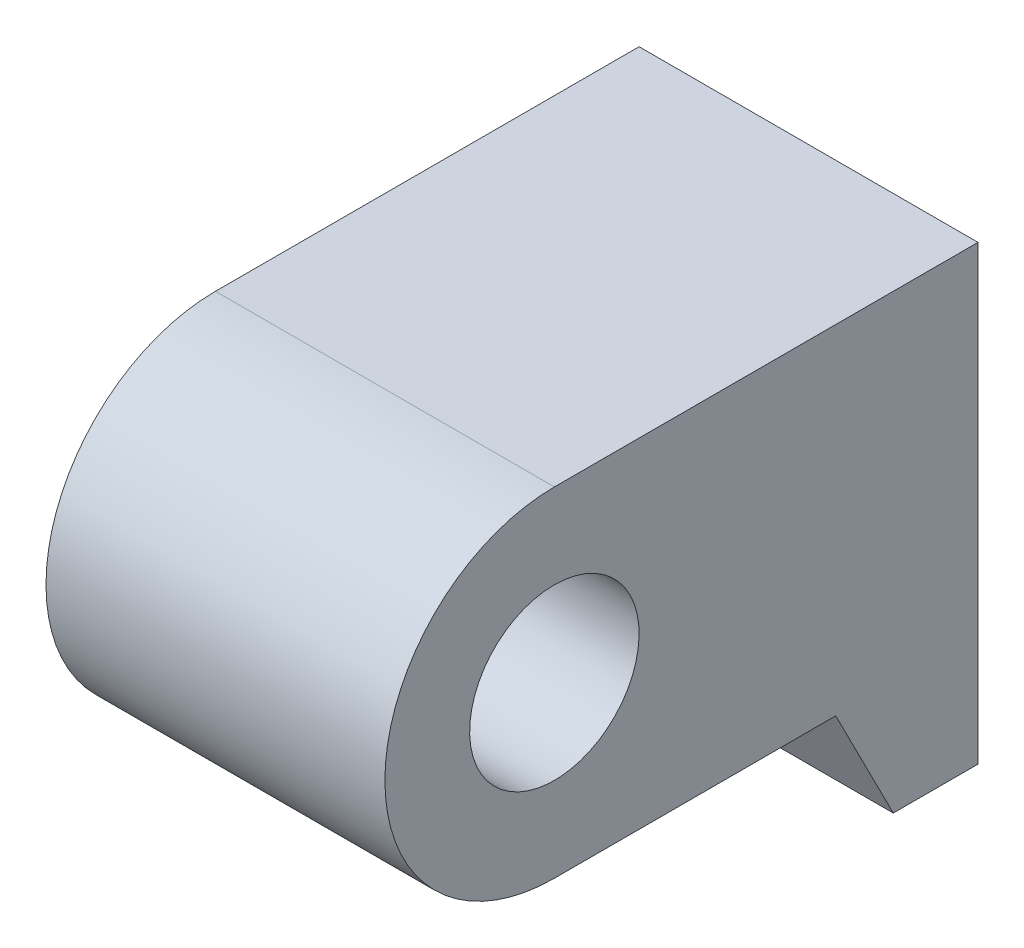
ISO-10303-21;
HEADER;
FILE_DESCRIPTION(('STEP AP214'),'2;1');
FILE_NAME('part.step','',(''),(''),'','','');
FILE_SCHEMA(('AUTOMOTIVE_DESIGN { 1 0 10303 214 1 1 1 1 }'));
ENDSEC;
DATA;
#1=APPLICATION_CONTEXT('core data for automotive mechanical design processes');
#2=APPLICATION_PROTOCOL_DEFINITION('international standard','automotive_design',2000,#1);
#3=PRODUCT_CONTEXT('',#1,'mechanical');
#4=PRODUCT('Part','Part','',(#3));
#5=PRODUCT_RELATED_PRODUCT_CATEGORY('part','',(#4));
#6=PRODUCT_DEFINITION_FORMATION('','',#4);
#7=PRODUCT_DEFINITION_CONTEXT('part definition',#1,'design');
#8=PRODUCT_DEFINITION('design','',#6,#7);
#9=PRODUCT_DEFINITION_SHAPE('','',#8);
#10=(LENGTH_UNIT() NAMED_UNIT(*) SI_UNIT(.MILLI.,.METRE.));
#11=(NAMED_UNIT(*) PLANE_ANGLE_UNIT() SI_UNIT($,.RADIAN.));
#12=(NAMED_UNIT(*) SI_UNIT($,.STERADIAN.) SOLID_ANGLE_UNIT());
#13=UNCERTAINTY_MEASURE_WITH_UNIT(LENGTH_MEASURE(1.E-05),#10,'distance_accuracy_value','');
#14=(GEOMETRIC_REPRESENTATION_CONTEXT(3) GLOBAL_UNCERTAINTY_ASSIGNED_CONTEXT((#13)) GLOBAL_UNIT_ASSIGNED_CONTEXT((#10,
#11,#12)) REPRESENTATION_CONTEXT('',''));
#15=CARTESIAN_POINT('',(0.,0.,0.));
#16=DIRECTION('',(0.,0.,1.));
#17=DIRECTION('',(1.,0.,0.));
#18=AXIS2_PLACEMENT_3D('',#15,#16,#17);
#19=CARTESIAN_POINT('',(6.,-8.,3.));
#20=DIRECTION('',(0.,-0.453990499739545,0.891006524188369));
#21=DIRECTION('',(0.,0.891006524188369,0.453990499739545));
#22=AXIS2_PLACEMENT_3D('',#19,#20,#21);
#23=PLANE('',#22);
#24=DIRECTION('',(-1.,0.,0.));
#25=VECTOR('',#24,1.);
#26=CARTESIAN_POINT('',(6.,-8.,3.));
#27=LINE('',#26,#25);
#28=CARTESIAN_POINT('',(6.,-8.,3.));
#29=VERTEX_POINT('',#28);
#30=CARTESIAN_POINT('',(-6.,-8.,3.));
#31=VERTEX_POINT('',#30);
#32=EDGE_CURVE('E9',#29,#31,#27,.T.);
#33=ORIENTED_EDGE('',*,*,#32,.F.);
#34=DIRECTION('',(0.,0.891006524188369,0.453990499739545));
#35=VECTOR('',#34,1.);
#36=CARTESIAN_POINT('',(6.,-8.,3.));
#37=LINE('',#36,#35);
#38=CARTESIAN_POINT('',(6.,-4.,5.0381017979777));
#39=VERTEX_POINT('',#38);
#40=EDGE_CURVE('E67',#29,#39,#37,.T.);
#41=ORIENTED_EDGE('',*,*,#40,.T.);
#42=DIRECTION('',(-1.,0.,0.));
#43=VECTOR('',#42,1.);
#44=CARTESIAN_POINT('',(6.,-4.,5.0381017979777));
#45=LINE('',#44,#43);
#46=CARTESIAN_POINT('',(-6.,-4.,5.0381017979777));
#47=VERTEX_POINT('',#46);
#48=EDGE_CURVE('E63',#39,#47,#45,.T.);
#49=ORIENTED_EDGE('',*,*,#48,.T.);
#50=DIRECTION('',(0.,0.891006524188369,0.453990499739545));
#51=VECTOR('',#50,1.);
#52=CARTESIAN_POINT('',(-6.,-8.,3.));
#53=LINE('',#52,#51);
#54=EDGE_CURVE('E65',#31,#47,#53,.T.);
#55=ORIENTED_EDGE('',*,*,#54,.F.);
#56=EDGE_LOOP('',(#33,#41,#49,#55));
#57=FACE_BOUND('',#56,.T.);
#58=ADVANCED_FACE('F14',(#57),#23,.T.);
#59=CARTESIAN_POINT('',(6.,-8.,0.));
#60=DIRECTION('',(0.,-1.,0.));
#61=DIRECTION('',(0.,0.,1.));
#62=AXIS2_PLACEMENT_3D('',#59,#60,#61);
#63=PLANE('',#62);
#64=DIRECTION('',(-1.,0.,0.));
#65=VECTOR('',#64,1.);
#66=CARTESIAN_POINT('',(6.,-8.,0.));
#67=LINE('',#66,#65);
#68=CARTESIAN_POINT('',(6.,-8.,0.));
#69=VERTEX_POINT('',#68);
#70=CARTESIAN_POINT('',(-6.,-8.,0.));
#71=VERTEX_POINT('',#70);
#72=EDGE_CURVE('E22',#69,#71,#67,.T.);
#73=ORIENTED_EDGE('',*,*,#72,.F.);
#74=DIRECTION('',(0.,0.,1.));
#75=VECTOR('',#74,1.);
#76=CARTESIAN_POINT('',(6.,-8.,0.));
#77=LINE('',#76,#75);
#78=EDGE_CURVE('E73',#69,#29,#77,.T.);
#79=ORIENTED_EDGE('',*,*,#78,.T.);
#80=ORIENTED_EDGE('',*,*,#32,.T.);
#81=DIRECTION('',(0.,0.,1.));
#82=VECTOR('',#81,1.);
#83=CARTESIAN_POINT('',(-6.,-8.,0.));
#84=LINE('',#83,#82);
#85=EDGE_CURVE('E82',#71,#31,#84,.T.);
#86=ORIENTED_EDGE('',*,*,#85,.F.);
#87=EDGE_LOOP('',(#73,#79,#80,#86));
#88=FACE_BOUND('',#87,.T.);
#89=ADVANCED_FACE('F16',(#88),#63,.T.);
#90=CARTESIAN_POINT('',(6.,-8.,0.));
#91=DIRECTION('',(0.,0.,1.));
#92=DIRECTION('',(1.,0.,0.));
#93=AXIS2_PLACEMENT_3D('',#90,#91,#92);
#94=PLANE('',#93);
#95=CARTESIAN_POINT('',(0.,0.,0.));
#96=DIRECTION('',(0.,0.,-1.));
#97=DIRECTION('',(-1.,0.,0.));
#98=AXIS2_PLACEMENT_3D('',#95,#96,#97);
#99=CIRCLE('',#98,3.);
#100=CARTESIAN_POINT('',(-3.,0.,0.));
#101=VERTEX_POINT('',#100);
#102=EDGE_CURVE('E172',#101,#101,#99,.T.);
#103=ORIENTED_EDGE('',*,*,#102,.F.);
#104=EDGE_LOOP('',(#103));
#105=FACE_BOUND('',#104,.T.);
#106=DIRECTION('',(-1.,0.,0.));
#107=VECTOR('',#106,1.);
#108=CARTESIAN_POINT('',(6.,8.,0.));
#109=LINE('',#108,#107);
#110=CARTESIAN_POINT('',(6.,8.,0.));
#111=VERTEX_POINT('',#110);
#112=CARTESIAN_POINT('',(-6.,8.,0.));
#113=VERTEX_POINT('',#112);
#114=EDGE_CURVE('E114',#111,#113,#109,.T.);
#115=ORIENTED_EDGE('',*,*,#114,.F.);
#116=DIRECTION('',(0.,1.,0.));
#117=VECTOR('',#116,1.);
#118=CARTESIAN_POINT('',(6.,-8.,0.));
#119=LINE('',#118,#117);
#120=EDGE_CURVE('E107',#69,#111,#119,.T.);
#121=ORIENTED_EDGE('',*,*,#120,.F.);
#122=ORIENTED_EDGE('',*,*,#72,.T.);
#123=DIRECTION('',(0.,1.,0.));
#124=VECTOR('',#123,1.);
#125=CARTESIAN_POINT('',(-6.,-8.,0.));
#126=LINE('',#125,#124);
#127=EDGE_CURVE('E94',#71,#113,#126,.T.);
#128=ORIENTED_EDGE('',*,*,#127,.T.);
#129=EDGE_LOOP('',(#115,#121,#122,#128));
#130=FACE_BOUND('',#129,.T.);
#131=ADVANCED_FACE('F116',(#105,#130),#94,.F.);
#132=CARTESIAN_POINT('',(6.,8.,0.));
#133=DIRECTION('',(0.,-1.,0.));
#134=DIRECTION('',(0.,0.,1.));
#135=AXIS2_PLACEMENT_3D('',#132,#133,#134);
#136=PLANE('',#135);
#137=DIRECTION('',(-1.,0.,0.));
#138=VECTOR('',#137,1.);
#139=CARTESIAN_POINT('',(6.,8.,15.));
#140=LINE('',#139,#138);
#141=CARTESIAN_POINT('',(6.,8.,15.));
#142=VERTEX_POINT('',#141);
#143=CARTESIAN_POINT('',(-6.,8.,15.));
#144=VERTEX_POINT('',#143);
#145=EDGE_CURVE('E112',#142,#144,#140,.T.);
#146=ORIENTED_EDGE('',*,*,#145,.F.);
#147=DIRECTION('',(0.,0.,1.));
#148=VECTOR('',#147,1.);
#149=CARTESIAN_POINT('',(6.,8.,0.));
#150=LINE('',#149,#148);
#151=EDGE_CURVE('E104',#111,#142,#150,.T.);
#152=ORIENTED_EDGE('',*,*,#151,.F.);
#153=ORIENTED_EDGE('',*,*,#114,.T.);
#154=DIRECTION('',(0.,0.,1.));
#155=VECTOR('',#154,1.);
#156=CARTESIAN_POINT('',(-6.,8.,0.));
#157=LINE('',#156,#155);
#158=EDGE_CURVE('E88',#113,#144,#157,.T.);
#159=ORIENTED_EDGE('',*,*,#158,.T.);
#160=EDGE_LOOP('',(#146,#152,#153,#159));
#161=FACE_BOUND('',#160,.T.);
#162=ADVANCED_FACE('F126',(#161),#136,.F.);
#163=CARTESIAN_POINT('',(6.,2.,15.));
#164=DIRECTION('',(-1.,0.,0.));
#165=DIRECTION('',(0.,1.,0.));
#166=AXIS2_PLACEMENT_3D('',#163,#164,#165);
#167=CYLINDRICAL_SURFACE('',#166,6.);
#168=DIRECTION('',(-1.,0.,0.));
#169=VECTOR('',#168,1.);
#170=CARTESIAN_POINT('',(6.,-4.,15.));
#171=LINE('',#170,#169);
#172=CARTESIAN_POINT('',(6.,-4.,15.));
#173=VERTEX_POINT('',#172);
#174=CARTESIAN_POINT('',(-6.,-4.,15.));
#175=VERTEX_POINT('',#174);
#176=EDGE_CURVE('E72',#173,#175,#171,.T.);
#177=ORIENTED_EDGE('',*,*,#176,.F.);
#178=CARTESIAN_POINT('',(6.,2.,15.));
#179=DIRECTION('',(-1.,0.,0.));
#180=DIRECTION('',(0.,1.,0.));
#181=AXIS2_PLACEMENT_3D('',#178,#179,#180);
#182=CIRCLE('',#181,6.);
#183=EDGE_CURVE('E101',#173,#142,#182,.T.);
#184=ORIENTED_EDGE('',*,*,#183,.T.);
#185=ORIENTED_EDGE('',*,*,#145,.T.);
#186=CARTESIAN_POINT('',(-6.,2.,15.));
#187=DIRECTION('',(-1.,0.,0.));
#188=DIRECTION('',(0.,1.,0.));
#189=AXIS2_PLACEMENT_3D('',#186,#187,#188);
#190=CIRCLE('',#189,6.);
#191=EDGE_CURVE('E86',#175,#144,#190,.T.);
#192=ORIENTED_EDGE('',*,*,#191,.F.);
#193=EDGE_LOOP('',(#177,#184,#185,#192));
#194=FACE_BOUND('',#193,.T.);
#195=ADVANCED_FACE('F124',(#194),#167,.T.);
#196=CARTESIAN_POINT('',(6.,-4.,5.0381017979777));
#197=DIRECTION('',(0.,-1.,0.));
#198=DIRECTION('',(0.,0.,1.));
#199=AXIS2_PLACEMENT_3D('',#196,#197,#198);
#200=PLANE('',#199);
#201=DIRECTION('',(0.,0.,1.));
#202=VECTOR('',#201,1.);
#203=CARTESIAN_POINT('',(6.,-4.,5.0381017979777));
#204=LINE('',#203,#202);
#205=EDGE_CURVE('E99',#39,#173,#204,.T.);
#206=ORIENTED_EDGE('',*,*,#205,.T.);
#207=ORIENTED_EDGE('',*,*,#176,.T.);
#208=DIRECTION('',(0.,0.,1.));
#209=VECTOR('',#208,1.);
#210=CARTESIAN_POINT('',(-6.,-4.,5.0381017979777));
#211=LINE('',#210,#209);
#212=EDGE_CURVE('E79',#47,#175,#211,.T.);
#213=ORIENTED_EDGE('',*,*,#212,.F.);
#214=ORIENTED_EDGE('',*,*,#48,.F.);
#215=EDGE_LOOP('',(#206,#207,#213,#214));
#216=FACE_BOUND('',#215,.T.);
#217=ADVANCED_FACE('F85',(#216),#200,.T.);
#218=CARTESIAN_POINT('',(6.,2.,15.));
#219=DIRECTION('',(-1.,0.,0.));
#220=DIRECTION('',(0.,1.,0.));
#221=AXIS2_PLACEMENT_3D('',#218,#219,#220);
#222=PLANE('',#221);
#223=CARTESIAN_POINT('',(6.,2.,15.));
#224=DIRECTION('',(-1.,0.,0.));
#225=DIRECTION('',(0.,1.,0.));
#226=AXIS2_PLACEMENT_3D('',#223,#224,#225);
#227=CIRCLE('',#226,3.);
#228=CARTESIAN_POINT('',(6.,5.,15.));
#229=VERTEX_POINT('',#228);
#230=EDGE_CURVE('E83',#229,#229,#227,.T.);
#231=ORIENTED_EDGE('',*,*,#230,.T.);
#232=EDGE_LOOP('',(#231));
#233=FACE_BOUND('',#232,.T.);
#234=ORIENTED_EDGE('',*,*,#40,.F.);
#235=ORIENTED_EDGE('',*,*,#78,.F.);
#236=ORIENTED_EDGE('',*,*,#120,.T.);
#237=ORIENTED_EDGE('',*,*,#151,.T.);
#238=ORIENTED_EDGE('',*,*,#183,.F.);
#239=ORIENTED_EDGE('',*,*,#205,.F.);
#240=EDGE_LOOP('',(#234,#235,#236,#237,#238,#239));
#241=FACE_BOUND('',#240,.T.);
#242=ADVANCED_FACE('F120',(#233,#241),#222,.F.);
#243=CARTESIAN_POINT('',(-6.,2.,15.));
#244=DIRECTION('',(-1.,0.,0.));
#245=DIRECTION('',(0.,1.,0.));
#246=AXIS2_PLACEMENT_3D('',#243,#244,#245);
#247=PLANE('',#246);
#248=CARTESIAN_POINT('',(-6.,2.,15.));
#249=DIRECTION('',(-1.,0.,0.));
#250=DIRECTION('',(0.,1.,0.));
#251=AXIS2_PLACEMENT_3D('',#248,#249,#250);
#252=CIRCLE('',#251,3.);
#253=CARTESIAN_POINT('',(-6.,5.,15.));
#254=VERTEX_POINT('',#253);
#255=EDGE_CURVE('E171',#254,#254,#252,.T.);
#256=ORIENTED_EDGE('',*,*,#255,.F.);
#257=EDGE_LOOP('',(#256));
#258=FACE_BOUND('',#257,.T.);
#259=ORIENTED_EDGE('',*,*,#54,.T.);
#260=ORIENTED_EDGE('',*,*,#212,.T.);
#261=ORIENTED_EDGE('',*,*,#191,.T.);
#262=ORIENTED_EDGE('',*,*,#158,.F.);
#263=ORIENTED_EDGE('',*,*,#127,.F.);
#264=ORIENTED_EDGE('',*,*,#85,.T.);
#265=EDGE_LOOP('',(#259,#260,#261,#262,#263,#264));
#266=FACE_BOUND('',#265,.T.);
#267=ADVANCED_FACE('F77',(#258,#266),#247,.T.);
#268=CARTESIAN_POINT('',(6.,2.,15.));
#269=DIRECTION('',(-1.,0.,0.));
#270=DIRECTION('',(0.,1.,0.));
#271=AXIS2_PLACEMENT_3D('',#268,#269,#270);
#272=CYLINDRICAL_SURFACE('',#271,3.);
#273=ORIENTED_EDGE('',*,*,#230,.F.);
#274=EDGE_LOOP('',(#273));
#275=FACE_BOUND('',#274,.T.);
#276=ORIENTED_EDGE('',*,*,#255,.T.);
#277=EDGE_LOOP('',(#276));
#278=FACE_BOUND('',#277,.T.);
#279=ADVANCED_FACE('F150',(#275,#278),#272,.F.);
#280=CARTESIAN_POINT('',(0.,0.,10.));
#281=DIRECTION('',(0.,0.,-1.));
#282=DIRECTION('',(-1.,0.,0.));
#283=AXIS2_PLACEMENT_3D('',#280,#281,#282);
#284=CYLINDRICAL_SURFACE('',#283,3.);
#285=CARTESIAN_POINT('',(0.,0.,10.));
#286=DIRECTION('',(0.,0.,-1.));
#287=DIRECTION('',(-1.,0.,0.));
#288=AXIS2_PLACEMENT_3D('',#285,#286,#287);
#289=CIRCLE('',#288,3.);
#290=CARTESIAN_POINT('',(-3.,0.,10.));
#291=VERTEX_POINT('',#290);
#292=EDGE_CURVE('E170',#291,#291,#289,.T.);
#293=ORIENTED_EDGE('',*,*,#292,.F.);
#294=EDGE_LOOP('',(#293));
#295=FACE_BOUND('',#294,.T.);
#296=ORIENTED_EDGE('',*,*,#102,.T.);
#297=EDGE_LOOP('',(#296));
#298=FACE_BOUND('',#297,.T.);
#299=ADVANCED_FACE('F155',(#295,#298),#284,.F.);
#300=CARTESIAN_POINT('',(0.,0.,10.));
#301=DIRECTION('',(0.,0.,-1.));
#302=DIRECTION('',(-1.,0.,0.));
#303=AXIS2_PLACEMENT_3D('',#300,#301,#302);
#304=PLANE('',#303);
#305=ORIENTED_EDGE('',*,*,#292,.T.);
#306=EDGE_LOOP('',(#305));
#307=FACE_BOUND('',#306,.T.);
#308=ADVANCED_FACE('F158',(#307),#304,.T.);
#309=CLOSED_SHELL('',(#58,#89,#131,#162,#195,#217,#242,#267,#279,#299,#308));
#310=MANIFOLD_SOLID_BREP('B1',#309);
#311=ADVANCED_BREP_SHAPE_REPRESENTATION('',(#18,#310),#14);
#312=SHAPE_DEFINITION_REPRESENTATION(#9,#311);
ENDSEC;
END-ISO-10303-21;
